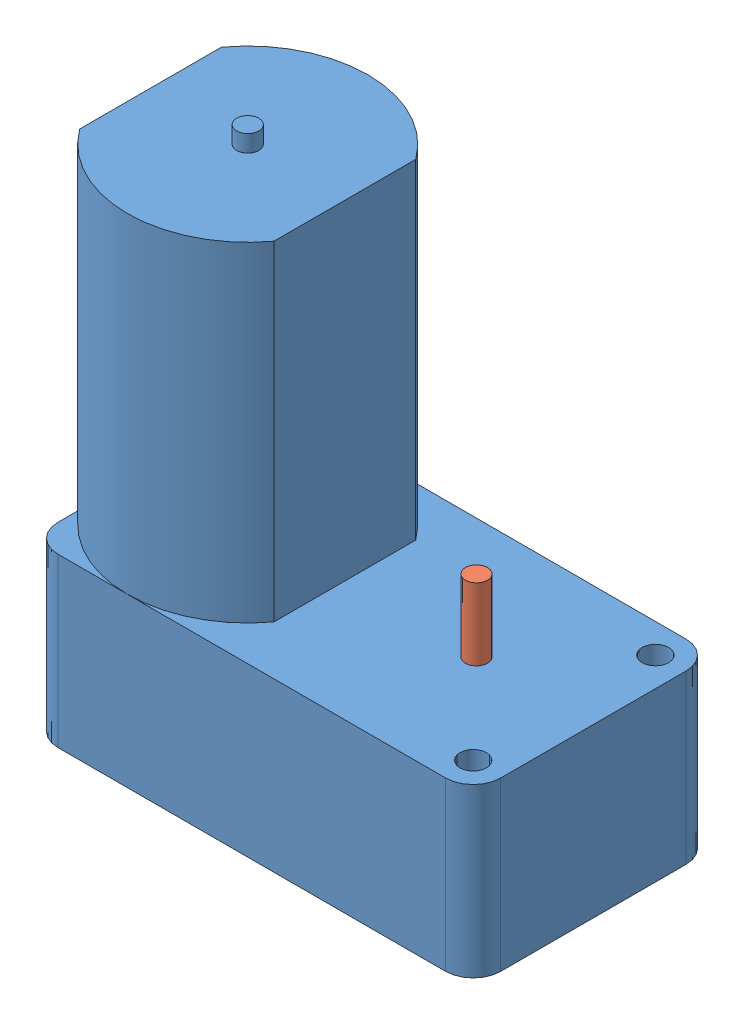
SolidWorks assembly Solarbotics motor B.SLDASM, configuration Default (file format 4400). Lengths in mm.
Overall size (41.8 54.37 22.7).
2 component instances, 2 part files, 2 mates.
Components (placement in the parent):
- GM8 Motor and Gear-1: GM8 Motor and Gear.SLDPRT [Default] at origin size (41.8 49.53 22.7)
- GM8 Output Shaft-1: GM8 Output Shaft.SLDPRT [Default] at (9.86 0 0) x (-0.837169 0 -0.546944) z (-0.546944 0 0.837169) size (4.73 28.44 7)
Mates (geometry in assembly coordinates):
- Concentric1: concentric: cylinder of GM8 Motor and Gear-1 through (9.86 15.81 0) axis (0 -1 0) radius 1.04; cylinder of GM8 Output Shaft-1 through (9.86 22.6 0) axis (0 -1 0) radius 1.0414
- Coincident1: coincident anti-aligned: plane of GM8 Motor and Gear-1 through (-20.9 0 11.35) normal (0 -1 0); plane of GM8 Output Shaft-1 through (9.86 0 0) normal (0 1 0)
